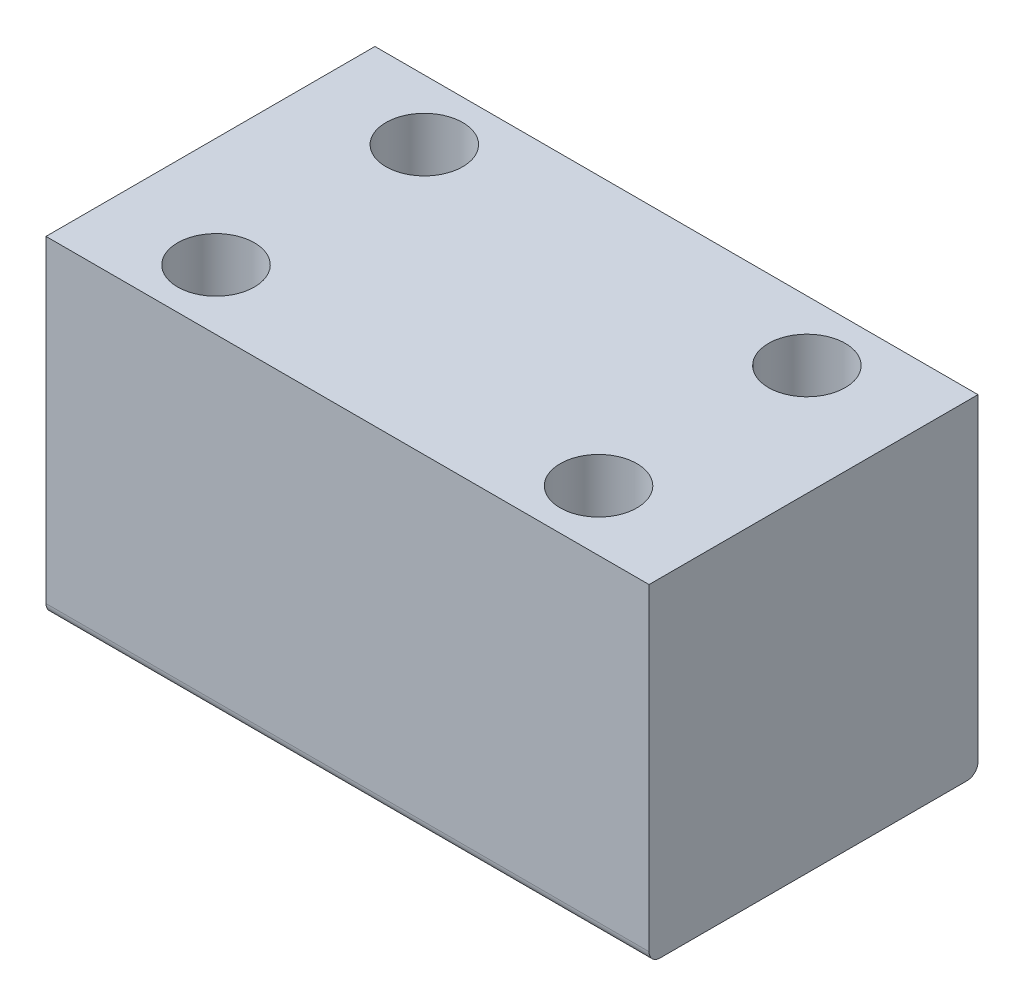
from build123d import *

# Parameters (mm, degrees)
SCHIZZO1_W                    = 30
SCHIZZO1_H                    = 30
ESTRUSIONE_ESTRUSIONE1_DEPTH  = 55
FORO_FILETTATO_M8X1_0_1_D     = 7
FORO_FILETTATO_M8X1_0_1_DEPTH = 31
FORO_FILETTATO_M8X1_0_1_TIP   = 2.103012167
FORO_FILETTATO_M8X1_0_3_D     = 7
FORO_FILETTATO_M8X1_0_3_DEPTH = 21
FORO_FILETTATO_M8X1_0_3_TIP   = 2.103012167
RACCORDO1_R                   = 1
RACCORDO3_R                   = 1


with BuildPart() as part:
    # Schizzo1 → Estrusione-Estrusione1 (new body)
    with BuildSketch(Plane(origin=(0, 0, 0), x_dir=(0, 0, -1), z_dir=(1, 0, 0))):
        Rectangle(SCHIZZO1_W, SCHIZZO1_H)
    extrude(amount=ESTRUSIONE_ESTRUSIONE1_DEPTH)

    # Foro filettato M8x1.0-1
    with Locations(Plane.ZY):
        with Locations((0, 0)):
            Hole(FORO_FILETTATO_M8X1_0_1_D / 2, depth=FORO_FILETTATO_M8X1_0_1_DEPTH)
            with Locations((0, 0, -(FORO_FILETTATO_M8X1_0_1_DEPTH + FORO_FILETTATO_M8X1_0_1_TIP / 2))):  # 118° drill point
                Cone(0, FORO_FILETTATO_M8X1_0_1_D / 2, FORO_FILETTATO_M8X1_0_1_TIP, mode=Mode.SUBTRACT)

    # Foro filettato M8x1.0-3
    with Locations(Plane(origin=(0, 15, 0), x_dir=(1, 0, 0), z_dir=(0, 1, 0))):
        with Locations((10.005088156, 9.5), (10.005088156, -9.5), (44.8952062, -9.5), (44.8952062, 9.5)):
            Hole(FORO_FILETTATO_M8X1_0_3_D / 2, depth=FORO_FILETTATO_M8X1_0_3_DEPTH)
            with Locations((0, 0, -(FORO_FILETTATO_M8X1_0_3_DEPTH + FORO_FILETTATO_M8X1_0_3_TIP / 2))):  # 118° drill point
                Cone(0, FORO_FILETTATO_M8X1_0_3_D / 2, FORO_FILETTATO_M8X1_0_3_TIP, mode=Mode.SUBTRACT)

    # Raccordo1
    raccordo1_edges = [part.edges().sort_by_distance(p)[0] for p in [
        (27.5, -15, 15),
    ]]
    fillet(raccordo1_edges, radius=RACCORDO1_R)

    # Raccordo3
    raccordo3_edges = [part.edges().sort_by_distance(p)[0] for p in [
        (27.5, -15, -15),
    ]]
    fillet(raccordo3_edges, radius=RACCORDO3_R)


solid = part.part
